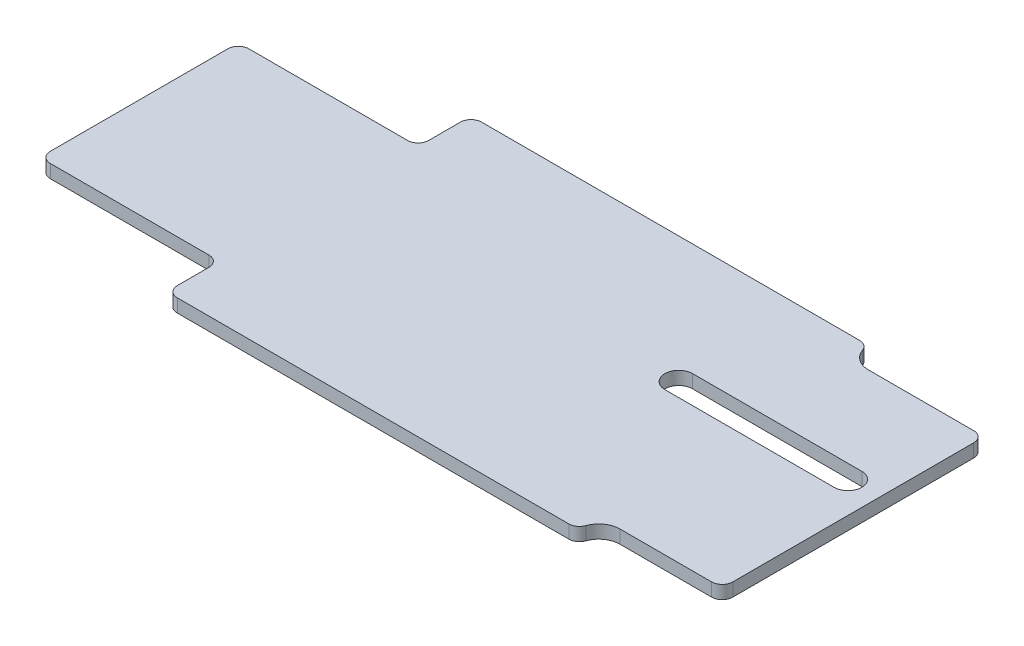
from build123d import *

# Parameters (mm, degrees)
BOSS_EXTRUDE1_DEPTH = 3.175


with BuildPart() as part:
    # Sketch1 → Boss-Extrude1 (new body)
    with BuildSketch(Plane(origin=(0, 0, 0), x_dir=(1, 0, 0), z_dir=(0, 1, 0))):
        with BuildLine():
            Line((-87.65721302, 32.398193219), (-87.65721302, -10.206986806))
            ThreePointArc((-87.65721302, -10.206986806), (-86.913264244, -12.00303803), (-85.11721302, -12.746986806))
            Line((-85.11721302, -12.746986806), (-47.01721302, -12.746986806))
            ThreePointArc((-47.01721302, -12.746986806), (-45.221161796, -13.490935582), (-44.47721302, -15.286986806))
            Line((-44.47721302, -15.286986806), (-44.47721302, -22.906986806))
            ThreePointArc((-44.47721302, -22.906986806), (-43.733264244, -24.70303803), (-41.93721302, -25.446986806))
            Line((-41.93721302, -25.446986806), (52.10930029, -25.446986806))
            ThreePointArc((52.10930029, -25.446986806), (53.575769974, -24.980888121), (54.504035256, -23.753653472))
            ThreePointArc((54.504035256, -23.753653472), (56.360565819, -21.299184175), (59.293505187, -20.366986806))
            Line((59.293505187, -20.366986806), (81.314494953, -20.366986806))
            ThreePointArc((81.314494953, -20.366986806), (83.110546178, -19.62303803), (83.854494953, -17.826986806))
            Line((83.854494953, -17.826986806), (83.854494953, 40.018193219))
            ThreePointArc((83.854494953, 40.018193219), (83.110546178, 41.814244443), (81.314494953, 42.558193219))
            Line((81.314494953, 42.558193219), (56.028359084, 42.558193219))
            ThreePointArc((56.028359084, 42.558193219), (53.095419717, 43.490390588), (51.238889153, 45.944859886))
            ThreePointArc((51.238889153, 45.944859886), (50.310623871, 47.172094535), (48.844154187, 47.638193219))
            Line((48.844154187, 47.638193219), (-41.93721302, 47.638193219))
            ThreePointArc((-41.93721302, 47.638193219), (-43.733264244, 46.894244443), (-44.47721302, 45.098193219))
            Line((-44.47721302, 45.098193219), (-44.47721302, 37.478193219))
            ThreePointArc((-44.47721302, 37.478193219), (-45.221161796, 35.682141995), (-47.01721302, 34.938193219))
            Line((-47.01721302, 34.938193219), (-85.11721302, 34.938193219))
            ThreePointArc((-85.11721302, 34.938193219), (-86.913264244, 34.194244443), (-87.65721302, 32.398193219))
        make_face()
        with BuildLine():
            Line((35.708359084, 20.670438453), (76.348359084, 20.670438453))
            ThreePointArc((76.348359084, 20.670438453), (79.680098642, 17.338698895), (76.348359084, 14.006959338))
            Line((76.348359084, 14.006959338), (35.708359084, 14.006959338))
            ThreePointArc((35.708359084, 14.006959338), (32.376619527, 17.338698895), (35.708359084, 20.670438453))
        make_face(mode=Mode.SUBTRACT)
    extrude(amount=BOSS_EXTRUDE1_DEPTH)


solid = part.part
